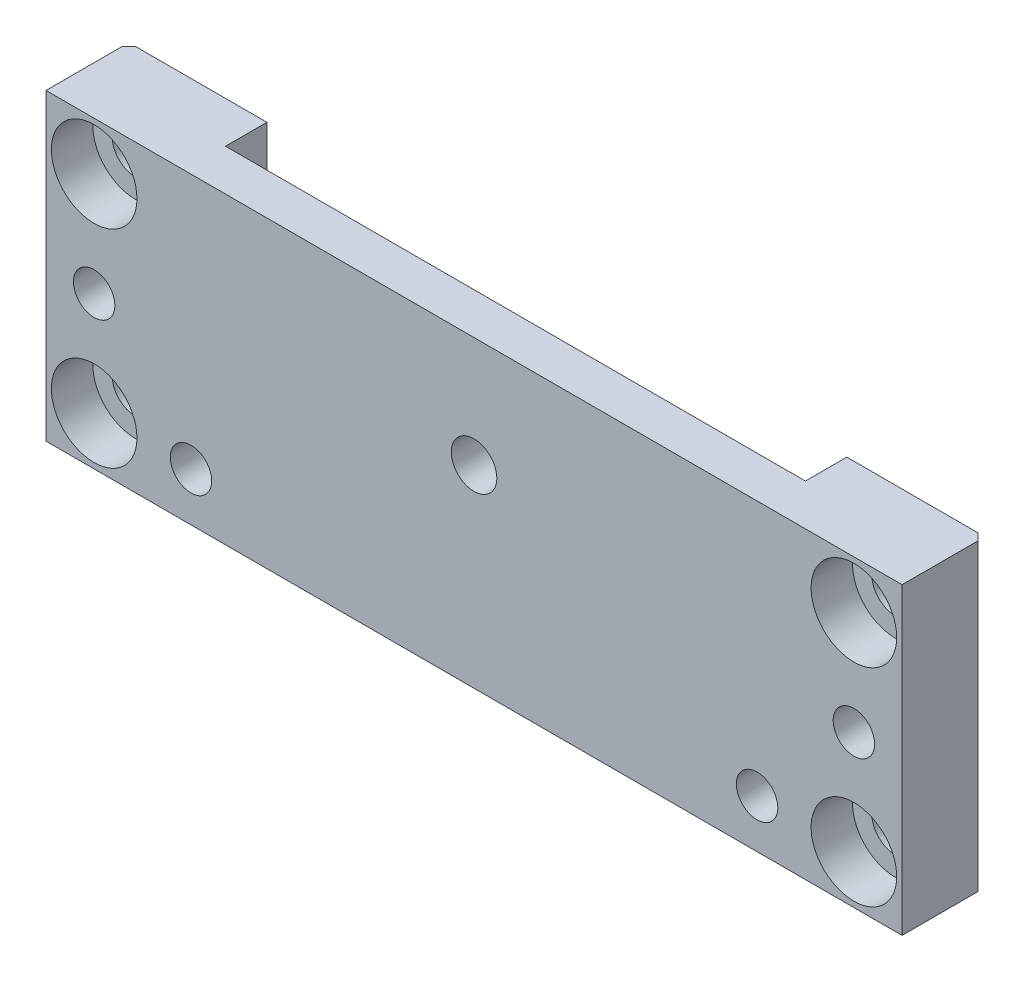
ISO-10303-21;
HEADER;
FILE_DESCRIPTION(('STEP AP214'),'2;1');
FILE_NAME('part.step','',(''),(''),'','','');
FILE_SCHEMA(('AUTOMOTIVE_DESIGN { 1 0 10303 214 1 1 1 1 }'));
ENDSEC;
DATA;
#1=APPLICATION_CONTEXT('core data for automotive mechanical design processes');
#2=APPLICATION_PROTOCOL_DEFINITION('international standard','automotive_design',2000,#1);
#3=PRODUCT_CONTEXT('',#1,'mechanical');
#4=PRODUCT('Part','Part','',(#3));
#5=PRODUCT_RELATED_PRODUCT_CATEGORY('part','',(#4));
#6=PRODUCT_DEFINITION_FORMATION('','',#4);
#7=PRODUCT_DEFINITION_CONTEXT('part definition',#1,'design');
#8=PRODUCT_DEFINITION('design','',#6,#7);
#9=PRODUCT_DEFINITION_SHAPE('','',#8);
#10=(LENGTH_UNIT() NAMED_UNIT(*) SI_UNIT(.MILLI.,.METRE.));
#11=(NAMED_UNIT(*) PLANE_ANGLE_UNIT() SI_UNIT($,.RADIAN.));
#12=(NAMED_UNIT(*) SI_UNIT($,.STERADIAN.) SOLID_ANGLE_UNIT());
#13=UNCERTAINTY_MEASURE_WITH_UNIT(LENGTH_MEASURE(1.E-05),#10,'distance_accuracy_value','');
#14=(GEOMETRIC_REPRESENTATION_CONTEXT(3) GLOBAL_UNCERTAINTY_ASSIGNED_CONTEXT((#13)) GLOBAL_UNIT_ASSIGNED_CONTEXT((#10,
#11,#12)) REPRESENTATION_CONTEXT('',''));
#15=CARTESIAN_POINT('',(0.,0.,0.));
#16=DIRECTION('',(0.,0.,1.));
#17=DIRECTION('',(1.,0.,0.));
#18=AXIS2_PLACEMENT_3D('',#15,#16,#17);
#19=CARTESIAN_POINT('',(-18.6154194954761,-10.3905810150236,3.));
#20=DIRECTION('',(1.,0.,0.));
#21=DIRECTION('',(0.,0.,-1.));
#22=AXIS2_PLACEMENT_3D('',#19,#20,#21);
#23=PLANE('',#22);
#24=DIRECTION('',(0.,1.,0.));
#25=VECTOR('',#24,1.);
#26=CARTESIAN_POINT('',(-18.6154194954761,-10.3905810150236,3.));
#27=LINE('',#26,#25);
#28=CARTESIAN_POINT('',(-18.6154194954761,-10.3905810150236,3.));
#29=VERTEX_POINT('',#28);
#30=CARTESIAN_POINT('',(-18.6154194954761,-8.30479457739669,3.));
#31=VERTEX_POINT('',#30);
#32=EDGE_CURVE('E185',#29,#31,#27,.T.);
#33=ORIENTED_EDGE('',*,*,#32,.T.);
#34=DIRECTION('',(0.,0.,-1.));
#35=VECTOR('',#34,1.);
#36=CARTESIAN_POINT('',(-18.6154194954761,-8.30479457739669,0.));
#37=LINE('',#36,#35);
#38=CARTESIAN_POINT('',(-18.6154194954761,-8.30479457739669,0.));
#39=VERTEX_POINT('',#38);
#40=EDGE_CURVE('E31',#31,#39,#37,.T.);
#41=ORIENTED_EDGE('',*,*,#40,.T.);
#42=DIRECTION('',(0.,1.,0.));
#43=VECTOR('',#42,1.);
#44=CARTESIAN_POINT('',(-18.6154194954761,-10.3905810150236,0.));
#45=LINE('',#44,#43);
#46=CARTESIAN_POINT('',(-18.6154194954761,-10.3905810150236,0.));
#47=VERTEX_POINT('',#46);
#48=EDGE_CURVE('E130',#47,#39,#45,.T.);
#49=ORIENTED_EDGE('',*,*,#48,.F.);
#50=DIRECTION('',(0.,0.,-1.));
#51=VECTOR('',#50,1.);
#52=CARTESIAN_POINT('',(-18.6154194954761,-10.3905810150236,3.));
#53=LINE('',#52,#51);
#54=EDGE_CURVE('E234',#29,#47,#53,.T.);
#55=ORIENTED_EDGE('',*,*,#54,.F.);
#56=EDGE_LOOP('',(#33,#41,#49,#55));
#57=FACE_BOUND('',#56,.T.);
#58=ADVANCED_FACE('F16',(#57),#23,.F.);
#59=CARTESIAN_POINT('',(-60.6154194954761,-10.3905810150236,3.));
#60=DIRECTION('',(-1.,0.,0.));
#61=DIRECTION('',(0.,0.,1.));
#62=AXIS2_PLACEMENT_3D('',#59,#60,#61);
#63=PLANE('',#62);
#64=DIRECTION('',(0.,1.,0.));
#65=VECTOR('',#64,1.);
#66=CARTESIAN_POINT('',(-60.6154194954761,-10.3905810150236,3.));
#67=LINE('',#66,#65);
#68=CARTESIAN_POINT('',(-60.6154194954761,-5.47636745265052,3.));
#69=VERTEX_POINT('',#68);
#70=CARTESIAN_POINT('',(-60.6154194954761,11.6094189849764,3.));
#71=VERTEX_POINT('',#70);
#72=EDGE_CURVE('E175',#69,#71,#67,.T.);
#73=ORIENTED_EDGE('',*,*,#72,.F.);
#74=DIRECTION('',(0.,0.,-1.));
#75=VECTOR('',#74,1.);
#76=CARTESIAN_POINT('',(-60.6154194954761,-5.47636745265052,0.));
#77=LINE('',#76,#75);
#78=CARTESIAN_POINT('',(-60.6154194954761,-5.47636745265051,0.));
#79=VERTEX_POINT('',#78);
#80=EDGE_CURVE('E38',#69,#79,#77,.T.);
#81=ORIENTED_EDGE('',*,*,#80,.T.);
#82=DIRECTION('',(0.,-1.,0.));
#83=VECTOR('',#82,1.);
#84=CARTESIAN_POINT('',(-60.6154194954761,-10.3905810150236,0.));
#85=LINE('',#84,#83);
#86=CARTESIAN_POINT('',(-60.6154194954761,11.6094189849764,0.));
#87=VERTEX_POINT('',#86);
#88=EDGE_CURVE('E145',#87,#79,#85,.T.);
#89=ORIENTED_EDGE('',*,*,#88,.F.);
#90=DIRECTION('',(0.,0.,1.));
#91=VECTOR('',#90,1.);
#92=CARTESIAN_POINT('',(-60.6154194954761,11.6094189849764,3.));
#93=LINE('',#92,#91);
#94=EDGE_CURVE('E183',#87,#71,#93,.T.);
#95=ORIENTED_EDGE('',*,*,#94,.T.);
#96=EDGE_LOOP('',(#73,#81,#89,#95));
#97=FACE_BOUND('',#96,.T.);
#98=ADVANCED_FACE('F181',(#97),#63,.F.);
#99=CARTESIAN_POINT('',(-8.61541949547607,-10.3905810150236,0.));
#100=DIRECTION('',(0.,0.,1.));
#101=DIRECTION('',(1.,0.,0.));
#102=AXIS2_PLACEMENT_3D('',#99,#100,#101);
#103=PLANE('',#102);
#104=CARTESIAN_POINT('',(-67.1279194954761,-6.8905810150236,0.));
#105=DIRECTION('',(0.,0.,1.));
#106=DIRECTION('',(1.,0.,0.));
#107=AXIS2_PLACEMENT_3D('',#104,#105,#106);
#108=CIRCLE('',#107,1.7);
#109=CARTESIAN_POINT('',(-65.4279194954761,-6.8905810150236,0.));
#110=VERTEX_POINT('',#109);
#111=EDGE_CURVE('E266',#110,#110,#108,.T.);
#112=ORIENTED_EDGE('',*,*,#111,.T.);
#113=EDGE_LOOP('',(#112));
#114=FACE_BOUND('',#113,.T.);
#115=CARTESIAN_POINT('',(-67.1279194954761,8.1094189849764,0.));
#116=DIRECTION('',(0.,0.,1.));
#117=DIRECTION('',(1.,0.,0.));
#118=AXIS2_PLACEMENT_3D('',#115,#116,#117);
#119=CIRCLE('',#118,1.7);
#120=CARTESIAN_POINT('',(-65.4279194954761,8.1094189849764,0.));
#121=VERTEX_POINT('',#120);
#122=EDGE_CURVE('E254',#121,#121,#119,.T.);
#123=ORIENTED_EDGE('',*,*,#122,.T.);
#124=EDGE_LOOP('',(#123));
#125=FACE_BOUND('',#124,.T.);
#126=CARTESIAN_POINT('',(-67.1279194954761,0.609418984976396,0.));
#127=DIRECTION('',(0.,0.,1.));
#128=DIRECTION('',(1.,0.,0.));
#129=AXIS2_PLACEMENT_3D('',#126,#127,#128);
#130=CIRCLE('',#129,1.5);
#131=CARTESIAN_POINT('',(-65.6279194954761,0.609418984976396,0.));
#132=VERTEX_POINT('',#131);
#133=EDGE_CURVE('E245',#132,#132,#130,.T.);
#134=ORIENTED_EDGE('',*,*,#133,.T.);
#135=EDGE_LOOP('',(#134));
#136=FACE_BOUND('',#135,.T.);
#137=ORIENTED_EDGE('',*,*,#88,.T.);
#138=CARTESIAN_POINT('',(-60.1154194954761,-6.89058101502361,0.));
#139=DIRECTION('',(0.,0.,-1.));
#140=DIRECTION('',(-1.,0.,0.));
#141=AXIS2_PLACEMENT_3D('',#138,#139,#140);
#142=CIRCLE('',#141,1.5);
#143=CARTESIAN_POINT('',(-60.6154194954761,-8.30479457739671,0.));
#144=VERTEX_POINT('',#143);
#145=EDGE_CURVE('E308',#144,#79,#142,.T.);
#146=ORIENTED_EDGE('',*,*,#145,.F.);
#147=CARTESIAN_POINT('',(-60.6154194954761,-10.3905810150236,0.));
#148=VERTEX_POINT('',#147);
#149=EDGE_CURVE('E139',#144,#148,#85,.T.);
#150=ORIENTED_EDGE('',*,*,#149,.T.);
#151=DIRECTION('',(1.,0.,0.));
#152=VECTOR('',#151,1.);
#153=CARTESIAN_POINT('',(-70.6154194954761,-10.3905810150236,0.));
#154=LINE('',#153,#152);
#155=CARTESIAN_POINT('',(-70.1154194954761,-10.3905810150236,0.));
#156=VERTEX_POINT('',#155);
#157=EDGE_CURVE('E205',#156,#148,#154,.T.);
#158=ORIENTED_EDGE('',*,*,#157,.F.);
#159=DIRECTION('',(0.,1.,0.));
#160=VECTOR('',#159,1.);
#161=CARTESIAN_POINT('',(-70.1154194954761,-10.3905810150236,0.));
#162=LINE('',#161,#160);
#163=CARTESIAN_POINT('',(-70.1154194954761,11.6094189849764,0.));
#164=VERTEX_POINT('',#163);
#165=EDGE_CURVE('E169',#156,#164,#162,.T.);
#166=ORIENTED_EDGE('',*,*,#165,.T.);
#167=DIRECTION('',(-1.,0.,0.));
#168=VECTOR('',#167,1.);
#169=CARTESIAN_POINT('',(-70.6154194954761,11.6094189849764,0.));
#170=LINE('',#169,#168);
#171=EDGE_CURVE('E208',#87,#164,#170,.T.);
#172=ORIENTED_EDGE('',*,*,#171,.F.);
#173=EDGE_LOOP('',(#137,#146,#150,#158,#166,#172));
#174=FACE_BOUND('',#173,.T.);
#175=ADVANCED_FACE('F355',(#114,#125,#136,#174),#103,.F.);
#176=CARTESIAN_POINT('',(-70.6154194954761,-10.3905810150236,6.));
#177=DIRECTION('',(0.,1.,0.));
#178=DIRECTION('',(0.,0.,1.));
#179=AXIS2_PLACEMENT_3D('',#176,#177,#178);
#180=PLANE('',#179);
#181=CARTESIAN_POINT('',(-9.11541949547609,-10.3905810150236,0.));
#182=VERTEX_POINT('',#181);
#183=EDGE_CURVE('E187',#47,#182,#154,.T.);
#184=ORIENTED_EDGE('',*,*,#183,.T.);
#185=DIRECTION('',(-0.707106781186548,0.,-0.707106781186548));
#186=VECTOR('',#185,1.);
#187=CARTESIAN_POINT('',(-8.61541949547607,-10.3905810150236,0.5));
#188=LINE('',#187,#186);
#189=CARTESIAN_POINT('',(-8.61541949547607,-10.3905810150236,0.5));
#190=VERTEX_POINT('',#189);
#191=EDGE_CURVE('E164',#182,#190,#188,.F.);
#192=ORIENTED_EDGE('',*,*,#191,.T.);
#193=DIRECTION('',(0.,0.,-1.));
#194=VECTOR('',#193,1.);
#195=CARTESIAN_POINT('',(-8.61541949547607,-10.3905810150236,6.));
#196=LINE('',#195,#194);
#197=CARTESIAN_POINT('',(-8.61541949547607,-10.3905810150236,6.));
#198=VERTEX_POINT('',#197);
#199=EDGE_CURVE('E137',#198,#190,#196,.T.);
#200=ORIENTED_EDGE('',*,*,#199,.F.);
#201=DIRECTION('',(1.,0.,0.));
#202=VECTOR('',#201,1.);
#203=CARTESIAN_POINT('',(-70.6154194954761,-10.3905810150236,6.));
#204=LINE('',#203,#202);
#205=CARTESIAN_POINT('',(-70.6154194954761,-10.3905810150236,6.));
#206=VERTEX_POINT('',#205);
#207=EDGE_CURVE('E194',#206,#198,#204,.T.);
#208=ORIENTED_EDGE('',*,*,#207,.F.);
#209=DIRECTION('',(0.,0.,-1.));
#210=VECTOR('',#209,1.);
#211=CARTESIAN_POINT('',(-70.6154194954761,-10.3905810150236,6.));
#212=LINE('',#211,#210);
#213=CARTESIAN_POINT('',(-70.6154194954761,-10.3905810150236,0.5));
#214=VERTEX_POINT('',#213);
#215=EDGE_CURVE('E204',#206,#214,#212,.T.);
#216=ORIENTED_EDGE('',*,*,#215,.T.);
#217=DIRECTION('',(-0.707106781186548,0.,0.707106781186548));
#218=VECTOR('',#217,1.);
#219=CARTESIAN_POINT('',(-70.6154194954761,-10.3905810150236,0.5));
#220=LINE('',#219,#218);
#221=EDGE_CURVE('E162',#214,#156,#220,.F.);
#222=ORIENTED_EDGE('',*,*,#221,.T.);
#223=ORIENTED_EDGE('',*,*,#157,.T.);
#224=DIRECTION('',(0.,0.,1.));
#225=VECTOR('',#224,1.);
#226=CARTESIAN_POINT('',(-60.6154194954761,-10.3905810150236,3.));
#227=LINE('',#226,#225);
#228=CARTESIAN_POINT('',(-60.6154194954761,-10.3905810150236,3.));
#229=VERTEX_POINT('',#228);
#230=EDGE_CURVE('E238',#148,#229,#227,.T.);
#231=ORIENTED_EDGE('',*,*,#230,.T.);
#232=DIRECTION('',(1.,0.,0.));
#233=VECTOR('',#232,1.);
#234=CARTESIAN_POINT('',(-18.6154194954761,-10.3905810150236,3.));
#235=LINE('',#234,#233);
#236=EDGE_CURVE('E236',#229,#29,#235,.T.);
#237=ORIENTED_EDGE('',*,*,#236,.T.);
#238=ORIENTED_EDGE('',*,*,#54,.T.);
#239=EDGE_LOOP('',(#184,#192,#200,#208,#216,#222,#223,#231,#237,#238));
#240=FACE_BOUND('',#239,.T.);
#241=ADVANCED_FACE('F231',(#240),#180,.F.);
#242=CARTESIAN_POINT('',(-8.61541949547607,-10.3905810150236,6.));
#243=DIRECTION('',(-1.,0.,0.));
#244=DIRECTION('',(0.,0.,1.));
#245=AXIS2_PLACEMENT_3D('',#242,#243,#244);
#246=PLANE('',#245);
#247=ORIENTED_EDGE('',*,*,#199,.T.);
#248=DIRECTION('',(0.,1.,0.));
#249=VECTOR('',#248,1.);
#250=CARTESIAN_POINT('',(-8.61541949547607,-10.3905810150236,0.5));
#251=LINE('',#250,#249);
#252=CARTESIAN_POINT('',(-8.61541949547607,11.6094189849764,0.5));
#253=VERTEX_POINT('',#252);
#254=EDGE_CURVE('E148',#190,#253,#251,.T.);
#255=ORIENTED_EDGE('',*,*,#254,.T.);
#256=DIRECTION('',(0.,0.,-1.));
#257=VECTOR('',#256,1.);
#258=CARTESIAN_POINT('',(-8.61541949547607,11.6094189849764,6.));
#259=LINE('',#258,#257);
#260=CARTESIAN_POINT('',(-8.61541949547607,11.6094189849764,6.));
#261=VERTEX_POINT('',#260);
#262=EDGE_CURVE('E141',#261,#253,#259,.T.);
#263=ORIENTED_EDGE('',*,*,#262,.F.);
#264=DIRECTION('',(0.,1.,0.));
#265=VECTOR('',#264,1.);
#266=CARTESIAN_POINT('',(-8.61541949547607,-10.3905810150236,6.));
#267=LINE('',#266,#265);
#268=EDGE_CURVE('E197',#198,#261,#267,.T.);
#269=ORIENTED_EDGE('',*,*,#268,.F.);
#270=EDGE_LOOP('',(#247,#255,#263,#269));
#271=FACE_BOUND('',#270,.T.);
#272=ADVANCED_FACE('F221',(#271),#246,.F.);
#273=CARTESIAN_POINT('',(-70.6154194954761,11.6094189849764,6.));
#274=DIRECTION('',(0.,-1.,0.));
#275=DIRECTION('',(0.,0.,-1.));
#276=AXIS2_PLACEMENT_3D('',#273,#274,#275);
#277=PLANE('',#276);
#278=ORIENTED_EDGE('',*,*,#262,.T.);
#279=DIRECTION('',(0.707106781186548,0.,0.707106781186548));
#280=VECTOR('',#279,1.);
#281=CARTESIAN_POINT('',(-8.61541949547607,11.6094189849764,0.5));
#282=LINE('',#281,#280);
#283=CARTESIAN_POINT('',(-9.11541949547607,11.6094189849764,0.));
#284=VERTEX_POINT('',#283);
#285=EDGE_CURVE('E158',#253,#284,#282,.F.);
#286=ORIENTED_EDGE('',*,*,#285,.T.);
#287=CARTESIAN_POINT('',(-18.6154194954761,11.6094189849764,0.));
#288=VERTEX_POINT('',#287);
#289=EDGE_CURVE('E198',#284,#288,#170,.T.);
#290=ORIENTED_EDGE('',*,*,#289,.T.);
#291=DIRECTION('',(0.,0.,-1.));
#292=VECTOR('',#291,1.);
#293=CARTESIAN_POINT('',(-18.6154194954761,11.6094189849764,3.));
#294=LINE('',#293,#292);
#295=CARTESIAN_POINT('',(-18.6154194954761,11.6094189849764,3.));
#296=VERTEX_POINT('',#295);
#297=EDGE_CURVE('E136',#296,#288,#294,.T.);
#298=ORIENTED_EDGE('',*,*,#297,.F.);
#299=DIRECTION('',(1.,0.,0.));
#300=VECTOR('',#299,1.);
#301=CARTESIAN_POINT('',(-18.6154194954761,11.6094189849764,3.));
#302=LINE('',#301,#300);
#303=EDGE_CURVE('E244',#71,#296,#302,.T.);
#304=ORIENTED_EDGE('',*,*,#303,.F.);
#305=ORIENTED_EDGE('',*,*,#94,.F.);
#306=ORIENTED_EDGE('',*,*,#171,.T.);
#307=DIRECTION('',(0.707106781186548,0.,-0.707106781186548));
#308=VECTOR('',#307,1.);
#309=CARTESIAN_POINT('',(-70.6154194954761,11.6094189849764,0.5));
#310=LINE('',#309,#308);
#311=CARTESIAN_POINT('',(-70.6154194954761,11.6094189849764,0.5));
#312=VERTEX_POINT('',#311);
#313=EDGE_CURVE('E156',#164,#312,#310,.F.);
#314=ORIENTED_EDGE('',*,*,#313,.T.);
#315=DIRECTION('',(0.,0.,-1.));
#316=VECTOR('',#315,1.);
#317=CARTESIAN_POINT('',(-70.6154194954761,11.6094189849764,6.));
#318=LINE('',#317,#316);
#319=CARTESIAN_POINT('',(-70.6154194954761,11.6094189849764,6.));
#320=VERTEX_POINT('',#319);
#321=EDGE_CURVE('E212',#320,#312,#318,.T.);
#322=ORIENTED_EDGE('',*,*,#321,.F.);
#323=DIRECTION('',(-1.,0.,0.));
#324=VECTOR('',#323,1.);
#325=CARTESIAN_POINT('',(-70.6154194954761,11.6094189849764,6.));
#326=LINE('',#325,#324);
#327=EDGE_CURVE('E200',#261,#320,#326,.T.);
#328=ORIENTED_EDGE('',*,*,#327,.F.);
#329=EDGE_LOOP('',(#278,#286,#290,#298,#304,#305,#306,#314,#322,#328));
#330=FACE_BOUND('',#329,.T.);
#331=ADVANCED_FACE('F218',(#330),#277,.F.);
#332=CARTESIAN_POINT('',(-70.6154194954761,-10.3905810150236,6.));
#333=DIRECTION('',(1.,0.,0.));
#334=DIRECTION('',(0.,0.,-1.));
#335=AXIS2_PLACEMENT_3D('',#332,#333,#334);
#336=PLANE('',#335);
#337=ORIENTED_EDGE('',*,*,#321,.T.);
#338=DIRECTION('',(0.,-1.,0.));
#339=VECTOR('',#338,1.);
#340=CARTESIAN_POINT('',(-70.6154194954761,-10.3905810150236,0.5));
#341=LINE('',#340,#339);
#342=EDGE_CURVE('E166',#312,#214,#341,.T.);
#343=ORIENTED_EDGE('',*,*,#342,.T.);
#344=ORIENTED_EDGE('',*,*,#215,.F.);
#345=DIRECTION('',(0.,-1.,0.));
#346=VECTOR('',#345,1.);
#347=CARTESIAN_POINT('',(-70.6154194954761,-10.3905810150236,6.));
#348=LINE('',#347,#346);
#349=EDGE_CURVE('E202',#320,#206,#348,.T.);
#350=ORIENTED_EDGE('',*,*,#349,.F.);
#351=EDGE_LOOP('',(#337,#343,#344,#350));
#352=FACE_BOUND('',#351,.T.);
#353=ADVANCED_FACE('F325',(#352),#336,.F.);
#354=CARTESIAN_POINT('',(-8.61541949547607,-10.3905810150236,6.));
#355=DIRECTION('',(0.,0.,1.));
#356=DIRECTION('',(1.,0.,0.));
#357=AXIS2_PLACEMENT_3D('',#354,#355,#356);
#358=PLANE('',#357);
#359=CARTESIAN_POINT('',(-39.615419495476,3.6094189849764,6.));
#360=DIRECTION('',(0.,0.,1.));
#361=DIRECTION('',(1.,0.,0.));
#362=AXIS2_PLACEMENT_3D('',#359,#360,#361);
#363=CIRCLE('',#362,1.65);
#364=CARTESIAN_POINT('',(-37.965419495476,3.6094189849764,6.));
#365=VERTEX_POINT('',#364);
#366=EDGE_CURVE('E315',#365,#365,#363,.T.);
#367=ORIENTED_EDGE('',*,*,#366,.F.);
#368=EDGE_LOOP('',(#367));
#369=FACE_BOUND('',#368,.T.);
#370=CARTESIAN_POINT('',(-19.1154194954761,-6.89058101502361,6.));
#371=DIRECTION('',(0.,0.,-1.));
#372=DIRECTION('',(-1.,0.,0.));
#373=AXIS2_PLACEMENT_3D('',#370,#371,#372);
#374=CIRCLE('',#373,1.5);
#375=CARTESIAN_POINT('',(-20.6154194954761,-6.89058101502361,6.));
#376=VERTEX_POINT('',#375);
#377=EDGE_CURVE('E121',#376,#376,#374,.T.);
#378=ORIENTED_EDGE('',*,*,#377,.T.);
#379=EDGE_LOOP('',(#378));
#380=FACE_BOUND('',#379,.T.);
#381=CARTESIAN_POINT('',(-60.1154194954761,-6.89058101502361,6.));
#382=DIRECTION('',(0.,0.,-1.));
#383=DIRECTION('',(-1.,0.,0.));
#384=AXIS2_PLACEMENT_3D('',#381,#382,#383);
#385=CIRCLE('',#384,1.5);
#386=CARTESIAN_POINT('',(-61.6154194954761,-6.89058101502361,6.));
#387=VERTEX_POINT('',#386);
#388=EDGE_CURVE('E305',#387,#387,#385,.T.);
#389=ORIENTED_EDGE('',*,*,#388,.T.);
#390=EDGE_LOOP('',(#389));
#391=FACE_BOUND('',#390,.T.);
#392=CARTESIAN_POINT('',(-12.1029194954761,-6.89058101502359,6.));
#393=DIRECTION('',(0.,0.,1.));
#394=DIRECTION('',(1.,0.,0.));
#395=AXIS2_PLACEMENT_3D('',#392,#393,#394);
#396=CIRCLE('',#395,3.1);
#397=CARTESIAN_POINT('',(-9.00291949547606,-6.89058101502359,6.));
#398=VERTEX_POINT('',#397);
#399=EDGE_CURVE('E299',#398,#398,#396,.T.);
#400=ORIENTED_EDGE('',*,*,#399,.F.);
#401=EDGE_LOOP('',(#400));
#402=FACE_BOUND('',#401,.T.);
#403=CARTESIAN_POINT('',(-12.1029194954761,8.1094189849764,6.));
#404=DIRECTION('',(0.,0.,1.));
#405=DIRECTION('',(1.,0.,0.));
#406=AXIS2_PLACEMENT_3D('',#403,#404,#405);
#407=CIRCLE('',#406,3.1);
#408=CARTESIAN_POINT('',(-9.00291949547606,8.1094189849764,6.));
#409=VERTEX_POINT('',#408);
#410=EDGE_CURVE('E287',#409,#409,#407,.T.);
#411=ORIENTED_EDGE('',*,*,#410,.F.);
#412=EDGE_LOOP('',(#411));
#413=FACE_BOUND('',#412,.T.);
#414=CARTESIAN_POINT('',(-67.1279194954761,-6.8905810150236,6.));
#415=DIRECTION('',(0.,0.,1.));
#416=DIRECTION('',(1.,0.,0.));
#417=AXIS2_PLACEMENT_3D('',#414,#415,#416);
#418=CIRCLE('',#417,3.1);
#419=CARTESIAN_POINT('',(-64.0279194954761,-6.8905810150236,6.));
#420=VERTEX_POINT('',#419);
#421=EDGE_CURVE('E275',#420,#420,#418,.T.);
#422=ORIENTED_EDGE('',*,*,#421,.F.);
#423=EDGE_LOOP('',(#422));
#424=FACE_BOUND('',#423,.T.);
#425=CARTESIAN_POINT('',(-67.1279194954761,8.1094189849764,6.));
#426=DIRECTION('',(0.,0.,1.));
#427=DIRECTION('',(1.,0.,0.));
#428=AXIS2_PLACEMENT_3D('',#425,#426,#427);
#429=CIRCLE('',#428,3.1);
#430=CARTESIAN_POINT('',(-64.0279194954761,8.1094189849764,6.));
#431=VERTEX_POINT('',#430);
#432=EDGE_CURVE('E263',#431,#431,#429,.T.);
#433=ORIENTED_EDGE('',*,*,#432,.F.);
#434=EDGE_LOOP('',(#433));
#435=FACE_BOUND('',#434,.T.);
#436=CARTESIAN_POINT('',(-12.102919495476,0.609418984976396,6.));
#437=DIRECTION('',(0.,0.,1.));
#438=DIRECTION('',(1.,0.,0.));
#439=AXIS2_PLACEMENT_3D('',#436,#437,#438);
#440=CIRCLE('',#439,1.5);
#441=CARTESIAN_POINT('',(-10.602919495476,0.609418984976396,6.));
#442=VERTEX_POINT('',#441);
#443=EDGE_CURVE('E153',#442,#442,#440,.T.);
#444=ORIENTED_EDGE('',*,*,#443,.F.);
#445=EDGE_LOOP('',(#444));
#446=FACE_BOUND('',#445,.T.);
#447=CARTESIAN_POINT('',(-67.1279194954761,0.609418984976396,6.));
#448=DIRECTION('',(0.,0.,1.));
#449=DIRECTION('',(1.,0.,0.));
#450=AXIS2_PLACEMENT_3D('',#447,#448,#449);
#451=CIRCLE('',#450,1.5);
#452=CARTESIAN_POINT('',(-65.6279194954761,0.609418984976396,6.));
#453=VERTEX_POINT('',#452);
#454=EDGE_CURVE('E152',#453,#453,#451,.T.);
#455=ORIENTED_EDGE('',*,*,#454,.F.);
#456=EDGE_LOOP('',(#455));
#457=FACE_BOUND('',#456,.T.);
#458=ORIENTED_EDGE('',*,*,#207,.T.);
#459=ORIENTED_EDGE('',*,*,#268,.T.);
#460=ORIENTED_EDGE('',*,*,#327,.T.);
#461=ORIENTED_EDGE('',*,*,#349,.T.);
#462=EDGE_LOOP('',(#458,#459,#460,#461));
#463=FACE_BOUND('',#462,.T.);
#464=ADVANCED_FACE('F322',(#369,#380,#391,#402,#413,#424,#435,#446,#457,#463),#358,.T.);
#465=CARTESIAN_POINT('',(-12.1029194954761,-6.89058101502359,0.));
#466=DIRECTION('',(0.,0.,1.));
#467=DIRECTION('',(1.,0.,0.));
#468=AXIS2_PLACEMENT_3D('',#465,#466,#467);
#469=CIRCLE('',#468,1.7);
#470=CARTESIAN_POINT('',(-10.4029194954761,-6.89058101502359,0.));
#471=VERTEX_POINT('',#470);
#472=EDGE_CURVE('E290',#471,#471,#469,.T.);
#473=ORIENTED_EDGE('',*,*,#472,.T.);
#474=EDGE_LOOP('',(#473));
#475=FACE_BOUND('',#474,.T.);
#476=CARTESIAN_POINT('',(-12.1029194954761,8.1094189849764,0.));
#477=DIRECTION('',(0.,0.,1.));
#478=DIRECTION('',(1.,0.,0.));
#479=AXIS2_PLACEMENT_3D('',#476,#477,#478);
#480=CIRCLE('',#479,1.7);
#481=CARTESIAN_POINT('',(-10.4029194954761,8.1094189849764,0.));
#482=VERTEX_POINT('',#481);
#483=EDGE_CURVE('E278',#482,#482,#480,.T.);
#484=ORIENTED_EDGE('',*,*,#483,.T.);
#485=EDGE_LOOP('',(#484));
#486=FACE_BOUND('',#485,.T.);
#487=CARTESIAN_POINT('',(-12.102919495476,0.609418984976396,0.));
#488=DIRECTION('',(0.,0.,1.));
#489=DIRECTION('',(1.,0.,0.));
#490=AXIS2_PLACEMENT_3D('',#487,#488,#489);
#491=CIRCLE('',#490,1.5);
#492=CARTESIAN_POINT('',(-10.602919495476,0.609418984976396,0.));
#493=VERTEX_POINT('',#492);
#494=EDGE_CURVE('E149',#493,#493,#491,.T.);
#495=ORIENTED_EDGE('',*,*,#494,.T.);
#496=EDGE_LOOP('',(#495));
#497=FACE_BOUND('',#496,.T.);
#498=ORIENTED_EDGE('',*,*,#48,.T.);
#499=CARTESIAN_POINT('',(-19.1154194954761,-6.89058101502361,0.));
#500=DIRECTION('',(0.,0.,-1.));
#501=DIRECTION('',(-1.,0.,0.));
#502=AXIS2_PLACEMENT_3D('',#499,#500,#501);
#503=CIRCLE('',#502,1.5);
#504=CARTESIAN_POINT('',(-18.6154194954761,-5.47636745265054,0.));
#505=VERTEX_POINT('',#504);
#506=EDGE_CURVE('E117',#505,#39,#503,.T.);
#507=ORIENTED_EDGE('',*,*,#506,.F.);
#508=EDGE_CURVE('E127',#505,#288,#45,.T.);
#509=ORIENTED_EDGE('',*,*,#508,.T.);
#510=ORIENTED_EDGE('',*,*,#289,.F.);
#511=DIRECTION('',(0.,-1.,0.));
#512=VECTOR('',#511,1.);
#513=CARTESIAN_POINT('',(-9.11541949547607,-10.3905810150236,0.));
#514=LINE('',#513,#512);
#515=EDGE_CURVE('E160',#284,#182,#514,.T.);
#516=ORIENTED_EDGE('',*,*,#515,.T.);
#517=ORIENTED_EDGE('',*,*,#183,.F.);
#518=EDGE_LOOP('',(#498,#507,#509,#510,#516,#517));
#519=FACE_BOUND('',#518,.T.);
#520=ADVANCED_FACE('F125',(#475,#486,#497,#519),#103,.F.);
#521=ORIENTED_EDGE('',*,*,#149,.F.);
#522=DIRECTION('',(0.,0.,-1.));
#523=VECTOR('',#522,1.);
#524=CARTESIAN_POINT('',(-60.6154194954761,-8.30479457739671,0.));
#525=LINE('',#524,#523);
#526=CARTESIAN_POINT('',(-60.6154194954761,-8.30479457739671,3.));
#527=VERTEX_POINT('',#526);
#528=EDGE_CURVE('E303',#144,#527,#525,.F.);
#529=ORIENTED_EDGE('',*,*,#528,.T.);
#530=EDGE_CURVE('E178',#229,#527,#67,.T.);
#531=ORIENTED_EDGE('',*,*,#530,.F.);
#532=ORIENTED_EDGE('',*,*,#230,.F.);
#533=EDGE_LOOP('',(#521,#529,#531,#532));
#534=FACE_BOUND('',#533,.T.);
#535=ADVANCED_FACE('F360',(#534),#63,.F.);
#536=ORIENTED_EDGE('',*,*,#508,.F.);
#537=DIRECTION('',(0.,0.,-1.));
#538=VECTOR('',#537,1.);
#539=CARTESIAN_POINT('',(-18.6154194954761,-5.47636745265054,0.));
#540=LINE('',#539,#538);
#541=CARTESIAN_POINT('',(-18.6154194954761,-5.47636745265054,3.));
#542=VERTEX_POINT('',#541);
#543=EDGE_CURVE('E114',#505,#542,#540,.F.);
#544=ORIENTED_EDGE('',*,*,#543,.T.);
#545=EDGE_CURVE('E189',#542,#296,#27,.T.);
#546=ORIENTED_EDGE('',*,*,#545,.T.);
#547=ORIENTED_EDGE('',*,*,#297,.T.);
#548=EDGE_LOOP('',(#536,#544,#546,#547));
#549=FACE_BOUND('',#548,.T.);
#550=ADVANCED_FACE('F134',(#549),#23,.F.);
#551=CARTESIAN_POINT('',(-18.6154194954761,-10.3905810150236,3.));
#552=DIRECTION('',(0.,0.,1.));
#553=DIRECTION('',(1.,0.,0.));
#554=AXIS2_PLACEMENT_3D('',#551,#552,#553);
#555=PLANE('',#554);
#556=CARTESIAN_POINT('',(-39.615419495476,3.6094189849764,3.));
#557=DIRECTION('',(0.,0.,1.));
#558=DIRECTION('',(1.,0.,0.));
#559=AXIS2_PLACEMENT_3D('',#556,#557,#558);
#560=CIRCLE('',#559,1.65);
#561=CARTESIAN_POINT('',(-37.965419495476,3.6094189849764,3.));
#562=VERTEX_POINT('',#561);
#563=EDGE_CURVE('E131',#562,#562,#560,.T.);
#564=ORIENTED_EDGE('',*,*,#563,.T.);
#565=EDGE_LOOP('',(#564));
#566=FACE_BOUND('',#565,.T.);
#567=ORIENTED_EDGE('',*,*,#545,.F.);
#568=CARTESIAN_POINT('',(-19.1154194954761,-6.89058101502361,3.));
#569=DIRECTION('',(0.,0.,1.));
#570=DIRECTION('',(1.,0.,0.));
#571=AXIS2_PLACEMENT_3D('',#568,#569,#570);
#572=CIRCLE('',#571,1.5);
#573=EDGE_CURVE('E11',#542,#31,#572,.T.);
#574=ORIENTED_EDGE('',*,*,#573,.T.);
#575=ORIENTED_EDGE('',*,*,#32,.F.);
#576=ORIENTED_EDGE('',*,*,#236,.F.);
#577=ORIENTED_EDGE('',*,*,#530,.T.);
#578=CARTESIAN_POINT('',(-60.1154194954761,-6.89058101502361,3.));
#579=DIRECTION('',(0.,0.,1.));
#580=DIRECTION('',(1.,0.,0.));
#581=AXIS2_PLACEMENT_3D('',#578,#579,#580);
#582=CIRCLE('',#581,1.5);
#583=EDGE_CURVE('E24',#527,#69,#582,.T.);
#584=ORIENTED_EDGE('',*,*,#583,.T.);
#585=ORIENTED_EDGE('',*,*,#72,.T.);
#586=ORIENTED_EDGE('',*,*,#303,.T.);
#587=EDGE_LOOP('',(#567,#574,#575,#576,#577,#584,#585,#586));
#588=FACE_BOUND('',#587,.T.);
#589=ADVANCED_FACE('F173',(#566,#588),#555,.F.);
#590=CARTESIAN_POINT('',(-67.1279194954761,0.609418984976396,-4.));
#591=DIRECTION('',(0.,0.,1.));
#592=DIRECTION('',(1.,0.,0.));
#593=AXIS2_PLACEMENT_3D('',#590,#591,#592);
#594=CYLINDRICAL_SURFACE('',#593,1.5);
#595=ORIENTED_EDGE('',*,*,#454,.T.);
#596=EDGE_LOOP('',(#595));
#597=FACE_BOUND('',#596,.T.);
#598=ORIENTED_EDGE('',*,*,#133,.F.);
#599=EDGE_LOOP('',(#598));
#600=FACE_BOUND('',#599,.T.);
#601=ADVANCED_FACE('F376',(#597,#600),#594,.F.);
#602=CARTESIAN_POINT('',(-12.102919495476,0.609418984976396,-4.));
#603=DIRECTION('',(0.,0.,1.));
#604=DIRECTION('',(1.,0.,0.));
#605=AXIS2_PLACEMENT_3D('',#602,#603,#604);
#606=CYLINDRICAL_SURFACE('',#605,1.5);
#607=ORIENTED_EDGE('',*,*,#443,.T.);
#608=EDGE_LOOP('',(#607));
#609=FACE_BOUND('',#608,.T.);
#610=ORIENTED_EDGE('',*,*,#494,.F.);
#611=EDGE_LOOP('',(#610));
#612=FACE_BOUND('',#611,.T.);
#613=ADVANCED_FACE('F387',(#609,#612),#606,.F.);
#614=CARTESIAN_POINT('',(-67.1279194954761,8.1094189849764,6.));
#615=DIRECTION('',(0.,0.,1.));
#616=DIRECTION('',(1.,0.,0.));
#617=AXIS2_PLACEMENT_3D('',#614,#615,#616);
#618=CYLINDRICAL_SURFACE('',#617,1.7);
#619=ORIENTED_EDGE('',*,*,#122,.F.);
#620=EDGE_LOOP('',(#619));
#621=FACE_BOUND('',#620,.T.);
#622=CARTESIAN_POINT('',(-67.1279194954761,8.1094189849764,3.));
#623=DIRECTION('',(0.,0.,1.));
#624=DIRECTION('',(1.,0.,0.));
#625=AXIS2_PLACEMENT_3D('',#622,#623,#624);
#626=CIRCLE('',#625,1.7);
#627=CARTESIAN_POINT('',(-65.4279194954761,8.1094189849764,3.));
#628=VERTEX_POINT('',#627);
#629=EDGE_CURVE('E257',#628,#628,#626,.T.);
#630=ORIENTED_EDGE('',*,*,#629,.T.);
#631=EDGE_LOOP('',(#630));
#632=FACE_BOUND('',#631,.T.);
#633=ADVANCED_FACE('F391',(#621,#632),#618,.F.);
#634=CARTESIAN_POINT('',(-65.4279194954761,8.1094189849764,3.));
#635=DIRECTION('',(0.,0.,-1.));
#636=DIRECTION('',(-1.,0.,0.));
#637=AXIS2_PLACEMENT_3D('',#634,#635,#636);
#638=PLANE('',#637);
#639=ORIENTED_EDGE('',*,*,#629,.F.);
#640=EDGE_LOOP('',(#639));
#641=FACE_BOUND('',#640,.T.);
#642=CARTESIAN_POINT('',(-67.1279194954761,8.1094189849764,3.));
#643=DIRECTION('',(0.,0.,1.));
#644=DIRECTION('',(1.,0.,0.));
#645=AXIS2_PLACEMENT_3D('',#642,#643,#644);
#646=CIRCLE('',#645,3.1);
#647=CARTESIAN_POINT('',(-64.0279194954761,8.1094189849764,3.));
#648=VERTEX_POINT('',#647);
#649=EDGE_CURVE('E260',#648,#648,#646,.T.);
#650=ORIENTED_EDGE('',*,*,#649,.T.);
#651=EDGE_LOOP('',(#650));
#652=FACE_BOUND('',#651,.T.);
#653=ADVANCED_FACE('F395',(#641,#652),#638,.F.);
#654=CARTESIAN_POINT('',(-67.1279194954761,8.1094189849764,6.));
#655=DIRECTION('',(0.,0.,1.));
#656=DIRECTION('',(1.,0.,0.));
#657=AXIS2_PLACEMENT_3D('',#654,#655,#656);
#658=CYLINDRICAL_SURFACE('',#657,3.1);
#659=ORIENTED_EDGE('',*,*,#649,.F.);
#660=EDGE_LOOP('',(#659));
#661=FACE_BOUND('',#660,.T.);
#662=ORIENTED_EDGE('',*,*,#432,.T.);
#663=EDGE_LOOP('',(#662));
#664=FACE_BOUND('',#663,.T.);
#665=ADVANCED_FACE('F399',(#661,#664),#658,.F.);
#666=CARTESIAN_POINT('',(-67.1279194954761,-6.8905810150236,6.));
#667=DIRECTION('',(0.,0.,1.));
#668=DIRECTION('',(1.,0.,0.));
#669=AXIS2_PLACEMENT_3D('',#666,#667,#668);
#670=CYLINDRICAL_SURFACE('',#669,1.7);
#671=ORIENTED_EDGE('',*,*,#111,.F.);
#672=EDGE_LOOP('',(#671));
#673=FACE_BOUND('',#672,.T.);
#674=CARTESIAN_POINT('',(-67.1279194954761,-6.8905810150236,3.));
#675=DIRECTION('',(0.,0.,1.));
#676=DIRECTION('',(1.,0.,0.));
#677=AXIS2_PLACEMENT_3D('',#674,#675,#676);
#678=CIRCLE('',#677,1.7);
#679=CARTESIAN_POINT('',(-65.4279194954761,-6.8905810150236,3.));
#680=VERTEX_POINT('',#679);
#681=EDGE_CURVE('E269',#680,#680,#678,.T.);
#682=ORIENTED_EDGE('',*,*,#681,.T.);
#683=EDGE_LOOP('',(#682));
#684=FACE_BOUND('',#683,.T.);
#685=ADVANCED_FACE('F403',(#673,#684),#670,.F.);
#686=CARTESIAN_POINT('',(-65.4279194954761,-6.8905810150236,3.));
#687=DIRECTION('',(0.,0.,-1.));
#688=DIRECTION('',(-1.,0.,0.));
#689=AXIS2_PLACEMENT_3D('',#686,#687,#688);
#690=PLANE('',#689);
#691=ORIENTED_EDGE('',*,*,#681,.F.);
#692=EDGE_LOOP('',(#691));
#693=FACE_BOUND('',#692,.T.);
#694=CARTESIAN_POINT('',(-67.1279194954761,-6.8905810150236,3.));
#695=DIRECTION('',(0.,0.,1.));
#696=DIRECTION('',(1.,0.,0.));
#697=AXIS2_PLACEMENT_3D('',#694,#695,#696);
#698=CIRCLE('',#697,3.1);
#699=CARTESIAN_POINT('',(-64.0279194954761,-6.8905810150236,3.));
#700=VERTEX_POINT('',#699);
#701=EDGE_CURVE('E272',#700,#700,#698,.T.);
#702=ORIENTED_EDGE('',*,*,#701,.T.);
#703=EDGE_LOOP('',(#702));
#704=FACE_BOUND('',#703,.T.);
#705=ADVANCED_FACE('F407',(#693,#704),#690,.F.);
#706=CARTESIAN_POINT('',(-67.1279194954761,-6.8905810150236,6.));
#707=DIRECTION('',(0.,0.,1.));
#708=DIRECTION('',(1.,0.,0.));
#709=AXIS2_PLACEMENT_3D('',#706,#707,#708);
#710=CYLINDRICAL_SURFACE('',#709,3.1);
#711=ORIENTED_EDGE('',*,*,#701,.F.);
#712=EDGE_LOOP('',(#711));
#713=FACE_BOUND('',#712,.T.);
#714=ORIENTED_EDGE('',*,*,#421,.T.);
#715=EDGE_LOOP('',(#714));
#716=FACE_BOUND('',#715,.T.);
#717=ADVANCED_FACE('F411',(#713,#716),#710,.F.);
#718=CARTESIAN_POINT('',(-12.1029194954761,8.1094189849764,6.));
#719=DIRECTION('',(0.,0.,1.));
#720=DIRECTION('',(1.,0.,0.));
#721=AXIS2_PLACEMENT_3D('',#718,#719,#720);
#722=CYLINDRICAL_SURFACE('',#721,1.7);
#723=ORIENTED_EDGE('',*,*,#483,.F.);
#724=EDGE_LOOP('',(#723));
#725=FACE_BOUND('',#724,.T.);
#726=CARTESIAN_POINT('',(-12.1029194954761,8.1094189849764,3.));
#727=DIRECTION('',(0.,0.,1.));
#728=DIRECTION('',(1.,0.,0.));
#729=AXIS2_PLACEMENT_3D('',#726,#727,#728);
#730=CIRCLE('',#729,1.7);
#731=CARTESIAN_POINT('',(-10.4029194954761,8.1094189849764,3.));
#732=VERTEX_POINT('',#731);
#733=EDGE_CURVE('E281',#732,#732,#730,.T.);
#734=ORIENTED_EDGE('',*,*,#733,.T.);
#735=EDGE_LOOP('',(#734));
#736=FACE_BOUND('',#735,.T.);
#737=ADVANCED_FACE('F415',(#725,#736),#722,.F.);
#738=CARTESIAN_POINT('',(-10.4029194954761,8.1094189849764,3.));
#739=DIRECTION('',(0.,0.,-1.));
#740=DIRECTION('',(-1.,0.,0.));
#741=AXIS2_PLACEMENT_3D('',#738,#739,#740);
#742=PLANE('',#741);
#743=ORIENTED_EDGE('',*,*,#733,.F.);
#744=EDGE_LOOP('',(#743));
#745=FACE_BOUND('',#744,.T.);
#746=CARTESIAN_POINT('',(-12.1029194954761,8.1094189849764,3.));
#747=DIRECTION('',(0.,0.,1.));
#748=DIRECTION('',(1.,0.,0.));
#749=AXIS2_PLACEMENT_3D('',#746,#747,#748);
#750=CIRCLE('',#749,3.1);
#751=CARTESIAN_POINT('',(-9.00291949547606,8.1094189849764,3.));
#752=VERTEX_POINT('',#751);
#753=EDGE_CURVE('E284',#752,#752,#750,.T.);
#754=ORIENTED_EDGE('',*,*,#753,.T.);
#755=EDGE_LOOP('',(#754));
#756=FACE_BOUND('',#755,.T.);
#757=ADVANCED_FACE('F419',(#745,#756),#742,.F.);
#758=CARTESIAN_POINT('',(-12.1029194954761,8.1094189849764,6.));
#759=DIRECTION('',(0.,0.,1.));
#760=DIRECTION('',(1.,0.,0.));
#761=AXIS2_PLACEMENT_3D('',#758,#759,#760);
#762=CYLINDRICAL_SURFACE('',#761,3.1);
#763=ORIENTED_EDGE('',*,*,#753,.F.);
#764=EDGE_LOOP('',(#763));
#765=FACE_BOUND('',#764,.T.);
#766=ORIENTED_EDGE('',*,*,#410,.T.);
#767=EDGE_LOOP('',(#766));
#768=FACE_BOUND('',#767,.T.);
#769=ADVANCED_FACE('F423',(#765,#768),#762,.F.);
#770=CARTESIAN_POINT('',(-12.1029194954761,-6.89058101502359,6.));
#771=DIRECTION('',(0.,0.,1.));
#772=DIRECTION('',(1.,0.,0.));
#773=AXIS2_PLACEMENT_3D('',#770,#771,#772);
#774=CYLINDRICAL_SURFACE('',#773,1.7);
#775=ORIENTED_EDGE('',*,*,#472,.F.);
#776=EDGE_LOOP('',(#775));
#777=FACE_BOUND('',#776,.T.);
#778=CARTESIAN_POINT('',(-12.1029194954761,-6.89058101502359,3.));
#779=DIRECTION('',(0.,0.,1.));
#780=DIRECTION('',(1.,0.,0.));
#781=AXIS2_PLACEMENT_3D('',#778,#779,#780);
#782=CIRCLE('',#781,1.7);
#783=CARTESIAN_POINT('',(-10.4029194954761,-6.89058101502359,3.));
#784=VERTEX_POINT('',#783);
#785=EDGE_CURVE('E293',#784,#784,#782,.T.);
#786=ORIENTED_EDGE('',*,*,#785,.T.);
#787=EDGE_LOOP('',(#786));
#788=FACE_BOUND('',#787,.T.);
#789=ADVANCED_FACE('F427',(#777,#788),#774,.F.);
#790=CARTESIAN_POINT('',(-10.4029194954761,-6.89058101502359,3.));
#791=DIRECTION('',(0.,0.,-1.));
#792=DIRECTION('',(-1.,0.,0.));
#793=AXIS2_PLACEMENT_3D('',#790,#791,#792);
#794=PLANE('',#793);
#795=ORIENTED_EDGE('',*,*,#785,.F.);
#796=EDGE_LOOP('',(#795));
#797=FACE_BOUND('',#796,.T.);
#798=CARTESIAN_POINT('',(-12.1029194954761,-6.89058101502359,3.));
#799=DIRECTION('',(0.,0.,1.));
#800=DIRECTION('',(1.,0.,0.));
#801=AXIS2_PLACEMENT_3D('',#798,#799,#800);
#802=CIRCLE('',#801,3.1);
#803=CARTESIAN_POINT('',(-9.00291949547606,-6.89058101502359,3.));
#804=VERTEX_POINT('',#803);
#805=EDGE_CURVE('E296',#804,#804,#802,.T.);
#806=ORIENTED_EDGE('',*,*,#805,.T.);
#807=EDGE_LOOP('',(#806));
#808=FACE_BOUND('',#807,.T.);
#809=ADVANCED_FACE('F431',(#797,#808),#794,.F.);
#810=CARTESIAN_POINT('',(-12.1029194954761,-6.89058101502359,6.));
#811=DIRECTION('',(0.,0.,1.));
#812=DIRECTION('',(1.,0.,0.));
#813=AXIS2_PLACEMENT_3D('',#810,#811,#812);
#814=CYLINDRICAL_SURFACE('',#813,3.1);
#815=ORIENTED_EDGE('',*,*,#805,.F.);
#816=EDGE_LOOP('',(#815));
#817=FACE_BOUND('',#816,.T.);
#818=ORIENTED_EDGE('',*,*,#399,.T.);
#819=EDGE_LOOP('',(#818));
#820=FACE_BOUND('',#819,.T.);
#821=ADVANCED_FACE('F435',(#817,#820),#814,.F.);
#822=CARTESIAN_POINT('',(-8.61541949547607,-10.3905810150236,0.5));
#823=DIRECTION('',(-0.707106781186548,0.,0.707106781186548));
#824=DIRECTION('',(0.707106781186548,0.,0.707106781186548));
#825=AXIS2_PLACEMENT_3D('',#822,#823,#824);
#826=PLANE('',#825);
#827=ORIENTED_EDGE('',*,*,#191,.F.);
#828=ORIENTED_EDGE('',*,*,#515,.F.);
#829=ORIENTED_EDGE('',*,*,#285,.F.);
#830=ORIENTED_EDGE('',*,*,#254,.F.);
#831=EDGE_LOOP('',(#827,#828,#829,#830));
#832=FACE_BOUND('',#831,.T.);
#833=ADVANCED_FACE('F226',(#832),#826,.F.);
#834=CARTESIAN_POINT('',(-70.6154194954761,-10.3905810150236,0.5));
#835=DIRECTION('',(0.707106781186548,0.,0.707106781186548));
#836=DIRECTION('',(0.707106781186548,0.,-0.707106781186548));
#837=AXIS2_PLACEMENT_3D('',#834,#835,#836);
#838=PLANE('',#837);
#839=ORIENTED_EDGE('',*,*,#313,.F.);
#840=ORIENTED_EDGE('',*,*,#165,.F.);
#841=ORIENTED_EDGE('',*,*,#221,.F.);
#842=ORIENTED_EDGE('',*,*,#342,.F.);
#843=EDGE_LOOP('',(#839,#840,#841,#842));
#844=FACE_BOUND('',#843,.T.);
#845=ADVANCED_FACE('F18',(#844),#838,.F.);
#846=CARTESIAN_POINT('',(-60.1154194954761,-6.89058101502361,0.));
#847=DIRECTION('',(0.,0.,-1.));
#848=DIRECTION('',(-1.,0.,0.));
#849=AXIS2_PLACEMENT_3D('',#846,#847,#848);
#850=CYLINDRICAL_SURFACE('',#849,1.5);
#851=ORIENTED_EDGE('',*,*,#388,.F.);
#852=EDGE_LOOP('',(#851));
#853=FACE_BOUND('',#852,.T.);
#854=ORIENTED_EDGE('',*,*,#583,.F.);
#855=ORIENTED_EDGE('',*,*,#528,.F.);
#856=ORIENTED_EDGE('',*,*,#145,.T.);
#857=ORIENTED_EDGE('',*,*,#80,.F.);
#858=EDGE_LOOP('',(#854,#855,#856,#857));
#859=FACE_BOUND('',#858,.T.);
#860=ADVANCED_FACE('F440',(#853,#859),#850,.F.);
#861=CARTESIAN_POINT('',(-19.1154194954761,-6.89058101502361,0.));
#862=DIRECTION('',(0.,0.,-1.));
#863=DIRECTION('',(-1.,0.,0.));
#864=AXIS2_PLACEMENT_3D('',#861,#862,#863);
#865=CYLINDRICAL_SURFACE('',#864,1.5);
#866=ORIENTED_EDGE('',*,*,#377,.F.);
#867=EDGE_LOOP('',(#866));
#868=FACE_BOUND('',#867,.T.);
#869=ORIENTED_EDGE('',*,*,#573,.F.);
#870=ORIENTED_EDGE('',*,*,#543,.F.);
#871=ORIENTED_EDGE('',*,*,#506,.T.);
#872=ORIENTED_EDGE('',*,*,#40,.F.);
#873=EDGE_LOOP('',(#869,#870,#871,#872));
#874=FACE_BOUND('',#873,.T.);
#875=ADVANCED_FACE('F116',(#868,#874),#865,.F.);
#876=CARTESIAN_POINT('',(-39.615419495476,3.6094189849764,6.));
#877=DIRECTION('',(0.,0.,1.));
#878=DIRECTION('',(1.,0.,0.));
#879=AXIS2_PLACEMENT_3D('',#876,#877,#878);
#880=CYLINDRICAL_SURFACE('',#879,1.65);
#881=ORIENTED_EDGE('',*,*,#366,.T.);
#882=EDGE_LOOP('',(#881));
#883=FACE_BOUND('',#882,.T.);
#884=ORIENTED_EDGE('',*,*,#563,.F.);
#885=EDGE_LOOP('',(#884));
#886=FACE_BOUND('',#885,.T.);
#887=ADVANCED_FACE('F319',(#883,#886),#880,.F.);
#888=CLOSED_SHELL('',(#58,#98,#175,#241,#272,#331,#353,#464,#520,#535,#550,#589,#601,#613,#633,
#653,#665,#685,#705,#717,#737,#757,#769,#789,#809,#821,#833,#845,#860,#875,#887));
#889=MANIFOLD_SOLID_BREP('B1',#888);
#890=ADVANCED_BREP_SHAPE_REPRESENTATION('',(#18,#889),#14);
#891=SHAPE_DEFINITION_REPRESENTATION(#9,#890);
ENDSEC;
END-ISO-10303-21;
